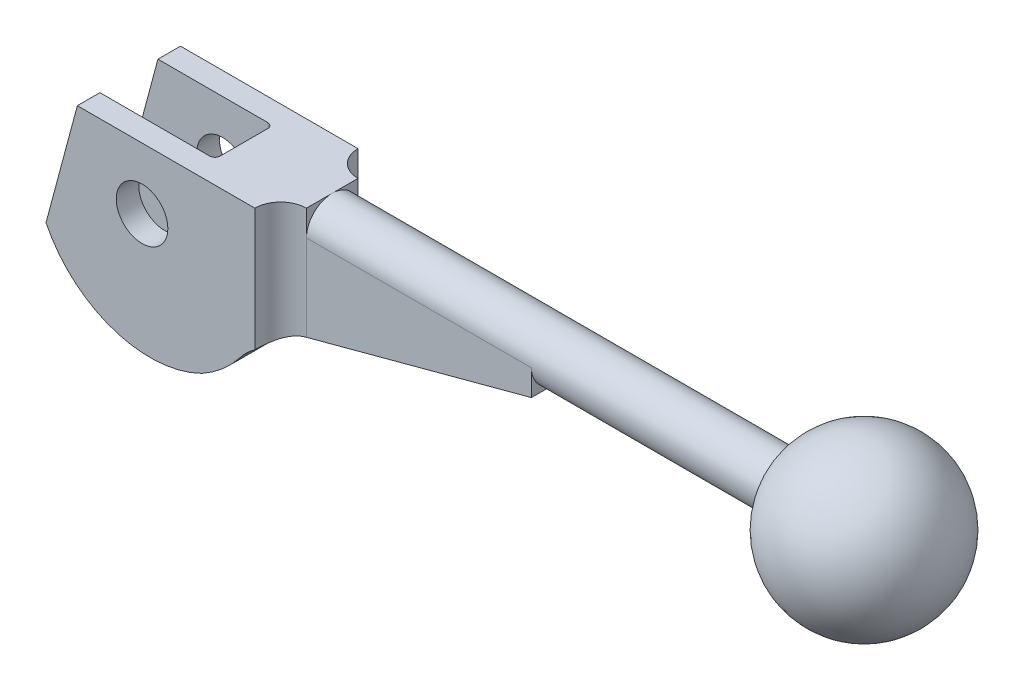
ISO-10303-21;
HEADER;
FILE_DESCRIPTION(('STEP AP214'),'2;1');
FILE_NAME('part.step','',(''),(''),'','','');
FILE_SCHEMA(('AUTOMOTIVE_DESIGN { 1 0 10303 214 1 1 1 1 }'));
ENDSEC;
DATA;
#1=APPLICATION_CONTEXT('core data for automotive mechanical design processes');
#2=APPLICATION_PROTOCOL_DEFINITION('international standard','automotive_design',2000,#1);
#3=PRODUCT_CONTEXT('',#1,'mechanical');
#4=PRODUCT('Part','Part','',(#3));
#5=PRODUCT_RELATED_PRODUCT_CATEGORY('part','',(#4));
#6=PRODUCT_DEFINITION_FORMATION('','',#4);
#7=PRODUCT_DEFINITION_CONTEXT('part definition',#1,'design');
#8=PRODUCT_DEFINITION('design','',#6,#7);
#9=PRODUCT_DEFINITION_SHAPE('','',#8);
#10=(LENGTH_UNIT() NAMED_UNIT(*) SI_UNIT(.MILLI.,.METRE.));
#11=(NAMED_UNIT(*) PLANE_ANGLE_UNIT() SI_UNIT($,.RADIAN.));
#12=(NAMED_UNIT(*) SI_UNIT($,.STERADIAN.) SOLID_ANGLE_UNIT());
#13=UNCERTAINTY_MEASURE_WITH_UNIT(LENGTH_MEASURE(1.E-05),#10,'distance_accuracy_value','');
#14=(GEOMETRIC_REPRESENTATION_CONTEXT(3) GLOBAL_UNCERTAINTY_ASSIGNED_CONTEXT((#13)) GLOBAL_UNIT_ASSIGNED_CONTEXT((#10,
#11,#12)) REPRESENTATION_CONTEXT('',''));
#15=CARTESIAN_POINT('',(0.,0.,0.));
#16=DIRECTION('',(0.,0.,1.));
#17=DIRECTION('',(1.,0.,0.));
#18=AXIS2_PLACEMENT_3D('',#15,#16,#17);
#19=CARTESIAN_POINT('',(-18.0306630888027,102.837421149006,3.7));
#20=DIRECTION('',(-0.258819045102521,0.965925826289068,0.));
#21=DIRECTION('',(-0.965925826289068,-0.258819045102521,0.));
#22=AXIS2_PLACEMENT_3D('',#19,#20,#21);
#23=CYLINDRICAL_SURFACE('',#22,0.8);
#24=DIRECTION('',(0.258819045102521,-0.965925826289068,0.));
#25=VECTOR('',#24,1.);
#26=CARTESIAN_POINT('',(-17.2579224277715,103.044476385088,3.7));
#27=LINE('',#26,#25);
#28=CARTESIAN_POINT('',(13.9013647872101,-13.2435666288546,3.7));
#29=VERTEX_POINT('',#28);
#30=CARTESIAN_POINT('',(7.80724447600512,9.5,3.7));
#31=VERTEX_POINT('',#30);
#32=EDGE_CURVE('E225',#29,#31,#27,.F.);
#33=ORIENTED_EDGE('',*,*,#32,.F.);
#34=CARTESIAN_POINT('',(13.2482136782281,-13.8969361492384,4.5));
#35=CARTESIAN_POINT('',(13.2976136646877,-13.8498706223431,4.5000178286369));
#36=CARTESIAN_POINT('',(13.3467861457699,-13.8024634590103,4.49327269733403));
#37=CARTESIAN_POINT('',(13.4429902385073,-13.7087684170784,4.4665040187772));
#38=CARTESIAN_POINT('',(13.4900102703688,-13.6624871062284,4.44641602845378));
#39=CARTESIAN_POINT('',(13.5729212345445,-13.5800863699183,4.39723866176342));
#40=CARTESIAN_POINT('',(13.6094197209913,-13.5434887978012,4.36997060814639));
#41=CARTESIAN_POINT('',(13.6779098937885,-13.4743135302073,4.30640427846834));
#42=CARTESIAN_POINT('',(13.7099160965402,-13.4417229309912,4.27013618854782));
#43=CARTESIAN_POINT('',(13.7611973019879,-13.3891923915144,4.19868446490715));
#44=CARTESIAN_POINT('',(13.7816982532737,-13.3680774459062,4.16523733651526));
#45=CARTESIAN_POINT('',(13.8185102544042,-13.3300215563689,4.09389019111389));
#46=CARTESIAN_POINT('',(13.8348204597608,-13.3130814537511,4.05598927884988));
#47=CARTESIAN_POINT('',(13.8625710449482,-13.2841835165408,3.9763426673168));
#48=CARTESIAN_POINT('',(13.8739794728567,-13.2722583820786,3.9345738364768));
#49=CARTESIAN_POINT('',(13.8910962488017,-13.2543427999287,3.84870754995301));
#50=CARTESIAN_POINT('',(13.8968194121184,-13.2483369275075,3.80461646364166));
#51=CARTESIAN_POINT('',(13.9001423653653,-13.2448496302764,3.75020495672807));
#52=CARTESIAN_POINT('',(13.9006008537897,-13.244368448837,3.7401684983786));
#53=CARTESIAN_POINT('',(13.9012115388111,-13.243727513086,3.72008944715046));
#54=CARTESIAN_POINT('',(13.9013641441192,-13.2435673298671,3.71004688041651));
#55=CARTESIAN_POINT('',(13.9013647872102,-13.2435666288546,3.7));
#56=B_SPLINE_CURVE_WITH_KNOTS('',3,(#34,#35,#36,#37,#38,#39,#40,#41,#42,#43,#44,#45,#46,#47,#48,
#49,#50,#51,#52,#53,#54,#55),.UNSPECIFIED.,.F.,.F.,(4,2,2,2,2,2,2,2,2,2,4),(0.,
0.204503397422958,0.410001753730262,0.584414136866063,0.758249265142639,0.891359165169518,
1.02449586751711,1.15848771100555,1.2921294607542,1.32229938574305,1.352428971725),.UNSPECIFIED.);
#57=CARTESIAN_POINT('',(13.2482136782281,-13.8969361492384,4.5));
#58=VERTEX_POINT('',#57);
#59=EDGE_CURVE('E165',#58,#29,#56,.T.);
#60=ORIENTED_EDGE('',*,*,#59,.F.);
#61=DIRECTION('',(0.258819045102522,-0.965925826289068,0.));
#62=VECTOR('',#61,1.);
#63=CARTESIAN_POINT('',(6.97902353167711,9.5,4.5));
#64=LINE('',#63,#62);
#65=CARTESIAN_POINT('',(6.97902353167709,9.5,4.5));
#66=VERTEX_POINT('',#65);
#67=EDGE_CURVE('E164',#66,#58,#64,.T.);
#68=ORIENTED_EDGE('',*,*,#67,.F.);
#69=CARTESIAN_POINT('',(6.97902353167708,9.5,3.7));
#70=DIRECTION('',(0.,-1.,0.));
#71=DIRECTION('',(-1.,0.,0.));
#72=AXIS2_PLACEMENT_3D('',#69,#70,#71);
#73=ELLIPSE('',#72,0.828220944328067,0.8);
#74=EDGE_CURVE('E18',#31,#66,#73,.T.);
#75=ORIENTED_EDGE('',*,*,#74,.F.);
#76=EDGE_LOOP('',(#33,#60,#68,#75));
#77=FACE_BOUND('',#76,.T.);
#78=ADVANCED_FACE('F14',(#77),#23,.F.);
#79=CARTESIAN_POINT('',(0.,0.,8.));
#80=DIRECTION('',(0.,0.,1.));
#81=DIRECTION('',(1.,0.,0.));
#82=AXIS2_PLACEMENT_3D('',#79,#80,#81);
#83=CYLINDRICAL_SURFACE('',#82,4.);
#84=CARTESIAN_POINT('',(0.,0.,-4.5));
#85=DIRECTION('',(0.,0.,1.));
#86=DIRECTION('',(1.,0.,0.));
#87=AXIS2_PLACEMENT_3D('',#84,#85,#86);
#88=CIRCLE('',#87,4.);
#89=CARTESIAN_POINT('',(4.,0.,-4.5));
#90=VERTEX_POINT('',#89);
#91=EDGE_CURVE('E222',#90,#90,#88,.F.);
#92=ORIENTED_EDGE('',*,*,#91,.F.);
#93=EDGE_LOOP('',(#92));
#94=FACE_BOUND('',#93,.T.);
#95=CARTESIAN_POINT('',(0.,0.,-8.));
#96=DIRECTION('',(0.,0.,1.));
#97=DIRECTION('',(1.,0.,0.));
#98=AXIS2_PLACEMENT_3D('',#95,#96,#97);
#99=CIRCLE('',#98,4.);
#100=CARTESIAN_POINT('',(4.,0.,-8.));
#101=VERTEX_POINT('',#100);
#102=EDGE_CURVE('E237',#101,#101,#99,.F.);
#103=ORIENTED_EDGE('',*,*,#102,.T.);
#104=EDGE_LOOP('',(#103));
#105=FACE_BOUND('',#104,.T.);
#106=ADVANCED_FACE('F435',(#94,#105),#83,.F.);
#107=CARTESIAN_POINT('',(1.25,-0.699999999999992,8.));
#108=DIRECTION('',(0.,0.,1.));
#109=DIRECTION('',(1.,0.,0.));
#110=AXIS2_PLACEMENT_3D('',#107,#108,#109);
#111=CYLINDRICAL_SURFACE('',#110,18.);
#112=CARTESIAN_POINT('',(1.25,-0.699999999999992,-8.));
#113=DIRECTION('',(0.,0.,1.));
#114=DIRECTION('',(1.,0.,0.));
#115=AXIS2_PLACEMENT_3D('',#112,#113,#114);
#116=CIRCLE('',#115,18.);
#117=CARTESIAN_POINT('',(-14.9,-8.64842751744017,-8.));
#118=VERTEX_POINT('',#117);
#119=CARTESIAN_POINT('',(9.25730095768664,-16.8208911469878,-8.));
#120=VERTEX_POINT('',#119);
#121=EDGE_CURVE('E236',#118,#120,#116,.T.);
#122=ORIENTED_EDGE('',*,*,#121,.T.);
#123=DIRECTION('',(0.,0.,1.));
#124=VECTOR('',#123,1.);
#125=CARTESIAN_POINT('',(9.25730095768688,-16.8208911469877,8.));
#126=LINE('',#125,#124);
#127=CARTESIAN_POINT('',(9.25730095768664,-16.8208911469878,-4.5));
#128=VERTEX_POINT('',#127);
#129=EDGE_CURVE('E246',#128,#120,#126,.F.);
#130=ORIENTED_EDGE('',*,*,#129,.F.);
#131=CARTESIAN_POINT('',(1.25,-0.699999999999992,-4.5));
#132=DIRECTION('',(0.,0.,1.));
#133=DIRECTION('',(1.,0.,0.));
#134=AXIS2_PLACEMENT_3D('',#131,#132,#133);
#135=CIRCLE('',#134,18.);
#136=CARTESIAN_POINT('',(-14.9,-8.64842751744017,-4.5));
#137=VERTEX_POINT('',#136);
#138=EDGE_CURVE('E221',#137,#128,#135,.T.);
#139=ORIENTED_EDGE('',*,*,#138,.F.);
#140=DIRECTION('',(0.,0.,1.));
#141=VECTOR('',#140,1.);
#142=CARTESIAN_POINT('',(-14.9,-8.64842751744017,8.));
#143=LINE('',#142,#141);
#144=EDGE_CURVE('E249',#118,#137,#143,.T.);
#145=ORIENTED_EDGE('',*,*,#144,.F.);
#146=EDGE_LOOP('',(#122,#130,#139,#145));
#147=FACE_BOUND('',#146,.T.);
#148=ADVANCED_FACE('F366',(#147),#111,.T.);
#149=CARTESIAN_POINT('',(-18.0306630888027,102.837421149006,-3.7));
#150=DIRECTION('',(-0.258819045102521,0.965925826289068,0.));
#151=DIRECTION('',(-0.965925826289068,-0.258819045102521,0.));
#152=AXIS2_PLACEMENT_3D('',#149,#150,#151);
#153=CYLINDRICAL_SURFACE('',#152,0.8);
#154=DIRECTION('',(-0.258819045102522,0.965925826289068,0.));
#155=VECTOR('',#154,1.);
#156=CARTESIAN_POINT('',(13.2482136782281,-13.8969361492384,-4.5));
#157=LINE('',#156,#155);
#158=CARTESIAN_POINT('',(13.2482136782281,-13.8969361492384,-4.5));
#159=VERTEX_POINT('',#158);
#160=CARTESIAN_POINT('',(6.97902353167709,9.5,-4.5));
#161=VERTEX_POINT('',#160);
#162=EDGE_CURVE('E213',#159,#161,#157,.T.);
#163=ORIENTED_EDGE('',*,*,#162,.F.);
#164=CARTESIAN_POINT('',(13.9013647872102,-13.2435666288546,-3.7));
#165=CARTESIAN_POINT('',(13.9013658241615,-13.2435652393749,-3.72021879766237));
#166=CARTESIAN_POINT('',(13.900744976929,-13.2442172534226,-3.74042682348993));
#167=CARTESIAN_POINT('',(13.8982758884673,-13.2468083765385,-3.78067709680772));
#168=CARTESIAN_POINT('',(13.8964281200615,-13.2487469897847,-3.80071940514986));
#169=CARTESIAN_POINT('',(13.8890957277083,-13.2564351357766,-3.86018215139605));
#170=CARTESIAN_POINT('',(13.8818215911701,-13.264057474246,-3.89916781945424));
#171=CARTESIAN_POINT('',(13.8628669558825,-13.2838663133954,-3.97474758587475));
#172=CARTESIAN_POINT('',(13.8511913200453,-13.296047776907,-4.01134427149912));
#173=CARTESIAN_POINT('',(13.8239312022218,-13.3243878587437,-4.08143577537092));
#174=CARTESIAN_POINT('',(13.8083428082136,-13.3405504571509,-4.1149274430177));
#175=CARTESIAN_POINT('',(13.7728035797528,-13.3772407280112,-4.18006821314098));
#176=CARTESIAN_POINT('',(13.7526496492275,-13.3979696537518,-4.21149207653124));
#177=CARTESIAN_POINT('',(13.7092459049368,-13.4423785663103,-4.26976088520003));
#178=CARTESIAN_POINT('',(13.6859953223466,-13.4660592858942,-4.29660468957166));
#179=CARTESIAN_POINT('',(13.6335759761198,-13.5191412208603,-4.34887446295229));
#180=CARTESIAN_POINT('',(13.6040338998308,-13.54887990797,-4.37358324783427));
#181=CARTESIAN_POINT('',(13.5424705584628,-13.6104149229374,-4.41655036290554));
#182=CARTESIAN_POINT('',(13.5104468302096,-13.6422132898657,-4.43480218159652));
#183=CARTESIAN_POINT('',(13.4408544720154,-13.7108008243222,-4.46642640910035));
#184=CARTESIAN_POINT('',(13.403071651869,-13.7477434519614,-4.47899650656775));
#185=CARTESIAN_POINT('',(13.3263143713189,-13.8221662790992,-4.49577922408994));
#186=CARTESIAN_POINT('',(13.287341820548,-13.8596455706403,-4.50000458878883));
#187=CARTESIAN_POINT('',(13.2482136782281,-13.8969361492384,-4.5));
#188=B_SPLINE_CURVE_WITH_KNOTS('',3,(#164,#165,#166,#167,#168,#169,#170,#171,#172,#173,#174,
#175,#176,#177,#178,#179,#180,#181,#182,#183,#184,#185,#186,#187),.UNSPECIFIED.,.F.,.F.,(4,2,2,
2,2,2,2,2,2,2,2,4),(0.,0.0606154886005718,0.121207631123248,0.24171325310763,0.362086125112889,
0.482579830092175,0.610181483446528,0.737814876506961,0.883210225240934,1.02875178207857,
1.19102739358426,1.35305497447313),.UNSPECIFIED.);
#189=CARTESIAN_POINT('',(13.9013647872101,-13.2435666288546,-3.7));
#190=VERTEX_POINT('',#189);
#191=EDGE_CURVE('E251',#190,#159,#188,.T.);
#192=ORIENTED_EDGE('',*,*,#191,.F.);
#193=DIRECTION('',(0.258819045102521,-0.965925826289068,0.));
#194=VECTOR('',#193,1.);
#195=CARTESIAN_POINT('',(-17.2579224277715,103.044476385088,-3.7));
#196=LINE('',#195,#194);
#197=CARTESIAN_POINT('',(7.80724447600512,9.5,-3.7));
#198=VERTEX_POINT('',#197);
#199=EDGE_CURVE('E228',#198,#190,#196,.T.);
#200=ORIENTED_EDGE('',*,*,#199,.F.);
#201=CARTESIAN_POINT('',(6.97902353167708,9.5,-3.7));
#202=DIRECTION('',(0.,-1.,0.));
#203=DIRECTION('',(-1.,0.,0.));
#204=AXIS2_PLACEMENT_3D('',#201,#202,#203);
#205=ELLIPSE('',#204,0.828220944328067,0.8);
#206=EDGE_CURVE('E162',#161,#198,#205,.T.);
#207=ORIENTED_EDGE('',*,*,#206,.F.);
#208=EDGE_LOOP('',(#163,#192,#200,#207));
#209=FACE_BOUND('',#208,.T.);
#210=ADVANCED_FACE('F344',(#209),#153,.F.);
#211=CARTESIAN_POINT('',(0.,0.,8.));
#212=DIRECTION('',(0.,0.,1.));
#213=DIRECTION('',(1.,0.,0.));
#214=AXIS2_PLACEMENT_3D('',#211,#212,#213);
#215=CYLINDRICAL_SURFACE('',#214,4.);
#216=CARTESIAN_POINT('',(0.,0.,4.5));
#217=DIRECTION('',(0.,0.,1.));
#218=DIRECTION('',(1.,0.,0.));
#219=AXIS2_PLACEMENT_3D('',#216,#217,#218);
#220=CIRCLE('',#219,4.);
#221=CARTESIAN_POINT('',(4.,0.,4.5));
#222=VERTEX_POINT('',#221);
#223=EDGE_CURVE('E170',#222,#222,#220,.T.);
#224=ORIENTED_EDGE('',*,*,#223,.F.);
#225=EDGE_LOOP('',(#224));
#226=FACE_BOUND('',#225,.T.);
#227=CARTESIAN_POINT('',(0.,0.,8.));
#228=DIRECTION('',(0.,0.,1.));
#229=DIRECTION('',(1.,0.,0.));
#230=AXIS2_PLACEMENT_3D('',#227,#228,#229);
#231=CIRCLE('',#230,4.);
#232=CARTESIAN_POINT('',(4.,0.,8.));
#233=VERTEX_POINT('',#232);
#234=EDGE_CURVE('E216',#233,#233,#231,.F.);
#235=ORIENTED_EDGE('',*,*,#234,.F.);
#236=EDGE_LOOP('',(#235));
#237=FACE_BOUND('',#236,.T.);
#238=ADVANCED_FACE('F358',(#226,#237),#215,.F.);
#239=CARTESIAN_POINT('',(1.25,-0.699999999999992,8.));
#240=DIRECTION('',(0.,0.,1.));
#241=DIRECTION('',(1.,0.,0.));
#242=AXIS2_PLACEMENT_3D('',#239,#240,#241);
#243=CYLINDRICAL_SURFACE('',#242,18.);
#244=CARTESIAN_POINT('',(1.25,-0.699999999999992,8.));
#245=DIRECTION('',(0.,0.,1.));
#246=DIRECTION('',(1.,0.,0.));
#247=AXIS2_PLACEMENT_3D('',#244,#245,#246);
#248=CIRCLE('',#247,18.);
#249=CARTESIAN_POINT('',(-14.9,-8.64842751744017,8.));
#250=VERTEX_POINT('',#249);
#251=CARTESIAN_POINT('',(9.25730095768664,-16.8208911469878,8.));
#252=VERTEX_POINT('',#251);
#253=EDGE_CURVE('E211',#250,#252,#248,.T.);
#254=ORIENTED_EDGE('',*,*,#253,.F.);
#255=DIRECTION('',(0.,0.,1.));
#256=VECTOR('',#255,1.);
#257=CARTESIAN_POINT('',(-14.9,-8.64842751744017,8.));
#258=LINE('',#257,#256);
#259=CARTESIAN_POINT('',(-14.9,-8.64842751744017,4.5));
#260=VERTEX_POINT('',#259);
#261=EDGE_CURVE('E241',#260,#250,#258,.T.);
#262=ORIENTED_EDGE('',*,*,#261,.F.);
#263=CARTESIAN_POINT('',(1.25,-0.699999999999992,4.5));
#264=DIRECTION('',(0.,0.,1.));
#265=DIRECTION('',(1.,0.,0.));
#266=AXIS2_PLACEMENT_3D('',#263,#264,#265);
#267=CIRCLE('',#266,18.);
#268=CARTESIAN_POINT('',(9.25730095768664,-16.8208911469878,4.5));
#269=VERTEX_POINT('',#268);
#270=EDGE_CURVE('E231',#269,#260,#267,.F.);
#271=ORIENTED_EDGE('',*,*,#270,.F.);
#272=DIRECTION('',(0.,0.,1.));
#273=VECTOR('',#272,1.);
#274=CARTESIAN_POINT('',(9.25730095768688,-16.8208911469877,8.));
#275=LINE('',#274,#273);
#276=EDGE_CURVE('E244',#252,#269,#275,.F.);
#277=ORIENTED_EDGE('',*,*,#276,.F.);
#278=EDGE_LOOP('',(#254,#262,#271,#277));
#279=FACE_BOUND('',#278,.T.);
#280=ADVANCED_FACE('F353',(#279),#243,.T.);
#281=CARTESIAN_POINT('',(0.,0.,8.));
#282=DIRECTION('',(0.,0.,1.));
#283=DIRECTION('',(1.,0.,0.));
#284=AXIS2_PLACEMENT_3D('',#281,#282,#283);
#285=CYLINDRICAL_SURFACE('',#284,19.2);
#286=DIRECTION('',(0.,0.,1.));
#287=VECTOR('',#286,1.);
#288=CARTESIAN_POINT('',(13.9013647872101,-13.2435666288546,3.7));
#289=LINE('',#288,#287);
#290=EDGE_CURVE('E227',#190,#29,#289,.T.);
#291=ORIENTED_EDGE('',*,*,#290,.F.);
#292=ORIENTED_EDGE('',*,*,#191,.T.);
#293=CARTESIAN_POINT('',(0.,0.,-4.5));
#294=DIRECTION('',(0.,0.,1.));
#295=DIRECTION('',(1.,0.,0.));
#296=AXIS2_PLACEMENT_3D('',#293,#294,#295);
#297=CIRCLE('',#296,19.2);
#298=EDGE_CURVE('E217',#128,#159,#297,.T.);
#299=ORIENTED_EDGE('',*,*,#298,.F.);
#300=ORIENTED_EDGE('',*,*,#129,.T.);
#301=CARTESIAN_POINT('',(0.,0.,-8.));
#302=DIRECTION('',(0.,0.,1.));
#303=DIRECTION('',(1.,0.,0.));
#304=AXIS2_PLACEMENT_3D('',#301,#302,#303);
#305=CIRCLE('',#304,19.2);
#306=CARTESIAN_POINT('',(15.2438186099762,-11.6733026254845,-8.));
#307=VERTEX_POINT('',#306);
#308=EDGE_CURVE('E243',#120,#307,#305,.T.);
#309=ORIENTED_EDGE('',*,*,#308,.T.);
#310=DIRECTION('',(0.,0.,1.));
#311=VECTOR('',#310,1.);
#312=CARTESIAN_POINT('',(15.2438186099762,-11.6733026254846,8.));
#313=LINE('',#312,#311);
#314=CARTESIAN_POINT('',(15.2438186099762,-11.6733026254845,8.));
#315=VERTEX_POINT('',#314);
#316=EDGE_CURVE('E238',#307,#315,#313,.T.);
#317=ORIENTED_EDGE('',*,*,#316,.T.);
#318=CARTESIAN_POINT('',(0.,0.,8.));
#319=DIRECTION('',(0.,0.,1.));
#320=DIRECTION('',(1.,0.,0.));
#321=AXIS2_PLACEMENT_3D('',#318,#319,#320);
#322=CIRCLE('',#321,19.2);
#323=EDGE_CURVE('E212',#252,#315,#322,.T.);
#324=ORIENTED_EDGE('',*,*,#323,.F.);
#325=ORIENTED_EDGE('',*,*,#276,.T.);
#326=CARTESIAN_POINT('',(0.,0.,4.5));
#327=DIRECTION('',(0.,0.,1.));
#328=DIRECTION('',(1.,0.,0.));
#329=AXIS2_PLACEMENT_3D('',#326,#327,#328);
#330=CIRCLE('',#329,19.2);
#331=EDGE_CURVE('E169',#58,#269,#330,.F.);
#332=ORIENTED_EDGE('',*,*,#331,.F.);
#333=ORIENTED_EDGE('',*,*,#59,.T.);
#334=EDGE_LOOP('',(#291,#292,#299,#300,#309,#317,#324,#325,#332,#333));
#335=FACE_BOUND('',#334,.T.);
#336=ADVANCED_FACE('F348',(#335),#285,.T.);
#337=CARTESIAN_POINT('',(-14.9,-8.64842751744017,8.));
#338=DIRECTION('',(-0.965925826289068,0.258819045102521,0.));
#339=DIRECTION('',(-0.258819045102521,-0.965925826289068,0.));
#340=AXIS2_PLACEMENT_3D('',#337,#338,#339);
#341=PLANE('',#340);
#342=DIRECTION('',(0.,0.,-1.));
#343=VECTOR('',#342,1.);
#344=CARTESIAN_POINT('',(-10.0371435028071,9.5,8.));
#345=LINE('',#344,#343);
#346=CARTESIAN_POINT('',(-10.0371435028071,9.5,-4.5));
#347=VERTEX_POINT('',#346);
#348=CARTESIAN_POINT('',(-10.0371435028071,9.5,-8.));
#349=VERTEX_POINT('',#348);
#350=EDGE_CURVE('E191',#347,#349,#345,.T.);
#351=ORIENTED_EDGE('',*,*,#350,.T.);
#352=DIRECTION('',(-0.258819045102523,-0.965925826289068,0.));
#353=VECTOR('',#352,1.);
#354=CARTESIAN_POINT('',(-10.0371435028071,9.5,-8.));
#355=LINE('',#354,#353);
#356=EDGE_CURVE('E233',#349,#118,#355,.T.);
#357=ORIENTED_EDGE('',*,*,#356,.T.);
#358=ORIENTED_EDGE('',*,*,#144,.T.);
#359=DIRECTION('',(-0.258819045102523,-0.965925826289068,0.));
#360=VECTOR('',#359,1.);
#361=CARTESIAN_POINT('',(-10.0371435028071,9.5,-4.5));
#362=LINE('',#361,#360);
#363=EDGE_CURVE('E218',#347,#137,#362,.T.);
#364=ORIENTED_EDGE('',*,*,#363,.F.);
#365=EDGE_LOOP('',(#351,#357,#358,#364));
#366=FACE_BOUND('',#365,.T.);
#367=ADVANCED_FACE('F318',(#366),#341,.T.);
#368=CARTESIAN_POINT('',(0.,0.,-8.));
#369=DIRECTION('',(0.,0.,1.));
#370=DIRECTION('',(1.,0.,0.));
#371=AXIS2_PLACEMENT_3D('',#368,#369,#370);
#372=PLANE('',#371);
#373=ORIENTED_EDGE('',*,*,#308,.F.);
#374=ORIENTED_EDGE('',*,*,#121,.F.);
#375=ORIENTED_EDGE('',*,*,#356,.F.);
#376=DIRECTION('',(1.,0.,0.));
#377=VECTOR('',#376,1.);
#378=CARTESIAN_POINT('',(23.5,9.5,-8.));
#379=LINE('',#378,#377);
#380=CARTESIAN_POINT('',(17.5,9.5,-8.));
#381=VERTEX_POINT('',#380);
#382=EDGE_CURVE('E189',#349,#381,#379,.T.);
#383=ORIENTED_EDGE('',*,*,#382,.T.);
#384=DIRECTION('',(0.,1.,0.));
#385=VECTOR('',#384,1.);
#386=CARTESIAN_POINT('',(17.5,19.5,-8.));
#387=LINE('',#386,#385);
#388=CARTESIAN_POINT('',(17.5,-9.52514578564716,-8.));
#389=VERTEX_POINT('',#388);
#390=EDGE_CURVE('E192',#381,#389,#387,.F.);
#391=ORIENTED_EDGE('',*,*,#390,.T.);
#392=CARTESIAN_POINT('',(23.1833074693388,-17.7531477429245,-8.));
#393=DIRECTION('',(0.,0.,1.));
#394=DIRECTION('',(1.,0.,0.));
#395=AXIS2_PLACEMENT_3D('',#392,#393,#394);
#396=CIRCLE('',#395,10.);
#397=EDGE_CURVE('E240',#389,#307,#396,.T.);
#398=ORIENTED_EDGE('',*,*,#397,.T.);
#399=EDGE_LOOP('',(#373,#374,#375,#383,#391,#398));
#400=FACE_BOUND('',#399,.T.);
#401=ORIENTED_EDGE('',*,*,#102,.F.);
#402=EDGE_LOOP('',(#401));
#403=FACE_BOUND('',#402,.T.);
#404=ADVANCED_FACE('F322',(#400,#403),#372,.F.);
#405=CARTESIAN_POINT('',(-14.9,-8.64842751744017,8.));
#406=DIRECTION('',(-0.965925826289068,0.258819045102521,0.));
#407=DIRECTION('',(-0.258819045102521,-0.965925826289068,0.));
#408=AXIS2_PLACEMENT_3D('',#405,#406,#407);
#409=PLANE('',#408);
#410=ORIENTED_EDGE('',*,*,#261,.T.);
#411=DIRECTION('',(-0.258819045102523,-0.965925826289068,0.));
#412=VECTOR('',#411,1.);
#413=CARTESIAN_POINT('',(-10.0371435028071,9.5,8.));
#414=LINE('',#413,#412);
#415=CARTESIAN_POINT('',(-10.0371435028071,9.5,8.));
#416=VERTEX_POINT('',#415);
#417=EDGE_CURVE('E208',#416,#250,#414,.T.);
#418=ORIENTED_EDGE('',*,*,#417,.F.);
#419=DIRECTION('',(0.,0.,-1.));
#420=VECTOR('',#419,1.);
#421=CARTESIAN_POINT('',(-10.0371435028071,9.5,8.));
#422=LINE('',#421,#420);
#423=CARTESIAN_POINT('',(-10.0371435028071,9.5,4.5));
#424=VERTEX_POINT('',#423);
#425=EDGE_CURVE('E178',#416,#424,#422,.T.);
#426=ORIENTED_EDGE('',*,*,#425,.T.);
#427=DIRECTION('',(0.258819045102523,0.965925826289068,0.));
#428=VECTOR('',#427,1.);
#429=CARTESIAN_POINT('',(-14.9,-8.64842751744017,4.5));
#430=LINE('',#429,#428);
#431=EDGE_CURVE('E177',#260,#424,#430,.T.);
#432=ORIENTED_EDGE('',*,*,#431,.F.);
#433=EDGE_LOOP('',(#410,#418,#426,#432));
#434=FACE_BOUND('',#433,.T.);
#435=ADVANCED_FACE('F386',(#434),#409,.T.);
#436=CARTESIAN_POINT('',(-117.714208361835,76.1272956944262,4.5));
#437=DIRECTION('',(0.,0.,-1.));
#438=DIRECTION('',(-1.,0.,0.));
#439=AXIS2_PLACEMENT_3D('',#436,#437,#438);
#440=PLANE('',#439);
#441=ORIENTED_EDGE('',*,*,#270,.T.);
#442=ORIENTED_EDGE('',*,*,#431,.T.);
#443=DIRECTION('',(1.,0.,0.));
#444=VECTOR('',#443,1.);
#445=CARTESIAN_POINT('',(23.5,9.5,4.5));
#446=LINE('',#445,#444);
#447=EDGE_CURVE('E159',#424,#66,#446,.T.);
#448=ORIENTED_EDGE('',*,*,#447,.T.);
#449=ORIENTED_EDGE('',*,*,#67,.T.);
#450=ORIENTED_EDGE('',*,*,#331,.T.);
#451=EDGE_LOOP('',(#441,#442,#448,#449,#450));
#452=FACE_BOUND('',#451,.T.);
#453=ORIENTED_EDGE('',*,*,#223,.T.);
#454=EDGE_LOOP('',(#453));
#455=FACE_BOUND('',#454,.T.);
#456=ADVANCED_FACE('F174',(#452,#455),#440,.T.);
#457=CARTESIAN_POINT('',(-17.2579224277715,103.044476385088,3.7));
#458=DIRECTION('',(-0.965925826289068,-0.258819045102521,0.));
#459=DIRECTION('',(0.258819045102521,-0.965925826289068,0.));
#460=AXIS2_PLACEMENT_3D('',#457,#458,#459);
#461=PLANE('',#460);
#462=ORIENTED_EDGE('',*,*,#290,.T.);
#463=ORIENTED_EDGE('',*,*,#32,.T.);
#464=DIRECTION('',(0.,0.,-1.));
#465=VECTOR('',#464,1.);
#466=CARTESIAN_POINT('',(7.80724447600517,9.5,8.));
#467=LINE('',#466,#465);
#468=EDGE_CURVE('E161',#31,#198,#467,.T.);
#469=ORIENTED_EDGE('',*,*,#468,.T.);
#470=ORIENTED_EDGE('',*,*,#199,.T.);
#471=EDGE_LOOP('',(#462,#463,#469,#470));
#472=FACE_BOUND('',#471,.T.);
#473=ADVANCED_FACE('F385',(#472),#461,.T.);
#474=CARTESIAN_POINT('',(-18.0306630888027,102.837421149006,-4.5));
#475=DIRECTION('',(0.,0.,1.));
#476=DIRECTION('',(1.,0.,0.));
#477=AXIS2_PLACEMENT_3D('',#474,#475,#476);
#478=PLANE('',#477);
#479=ORIENTED_EDGE('',*,*,#298,.T.);
#480=ORIENTED_EDGE('',*,*,#162,.T.);
#481=DIRECTION('',(1.,0.,0.));
#482=VECTOR('',#481,1.);
#483=CARTESIAN_POINT('',(23.5,9.5,-4.5));
#484=LINE('',#483,#482);
#485=EDGE_CURVE('E180',#161,#347,#484,.F.);
#486=ORIENTED_EDGE('',*,*,#485,.T.);
#487=ORIENTED_EDGE('',*,*,#363,.T.);
#488=ORIENTED_EDGE('',*,*,#138,.T.);
#489=EDGE_LOOP('',(#479,#480,#486,#487,#488));
#490=FACE_BOUND('',#489,.T.);
#491=ORIENTED_EDGE('',*,*,#91,.T.);
#492=EDGE_LOOP('',(#491));
#493=FACE_BOUND('',#492,.T.);
#494=ADVANCED_FACE('F310',(#490,#493),#478,.T.);
#495=CARTESIAN_POINT('',(0.,0.,8.));
#496=DIRECTION('',(0.,0.,1.));
#497=DIRECTION('',(1.,0.,0.));
#498=AXIS2_PLACEMENT_3D('',#495,#496,#497);
#499=PLANE('',#498);
#500=ORIENTED_EDGE('',*,*,#417,.T.);
#501=ORIENTED_EDGE('',*,*,#253,.T.);
#502=ORIENTED_EDGE('',*,*,#323,.T.);
#503=CARTESIAN_POINT('',(23.1833074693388,-17.7531477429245,8.));
#504=DIRECTION('',(0.,0.,1.));
#505=DIRECTION('',(1.,0.,0.));
#506=AXIS2_PLACEMENT_3D('',#503,#504,#505);
#507=CIRCLE('',#506,10.);
#508=CARTESIAN_POINT('',(17.5,-9.52514578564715,8.));
#509=VERTEX_POINT('',#508);
#510=EDGE_CURVE('E198',#315,#509,#507,.F.);
#511=ORIENTED_EDGE('',*,*,#510,.T.);
#512=DIRECTION('',(0.,1.,0.));
#513=VECTOR('',#512,1.);
#514=CARTESIAN_POINT('',(17.5,19.5,8.));
#515=LINE('',#514,#513);
#516=CARTESIAN_POINT('',(17.5,9.5,8.));
#517=VERTEX_POINT('',#516);
#518=EDGE_CURVE('E303',#509,#517,#515,.T.);
#519=ORIENTED_EDGE('',*,*,#518,.T.);
#520=DIRECTION('',(1.,0.,0.));
#521=VECTOR('',#520,1.);
#522=CARTESIAN_POINT('',(23.5,9.5,8.));
#523=LINE('',#522,#521);
#524=EDGE_CURVE('E182',#517,#416,#523,.F.);
#525=ORIENTED_EDGE('',*,*,#524,.T.);
#526=EDGE_LOOP('',(#500,#501,#502,#511,#519,#525));
#527=FACE_BOUND('',#526,.T.);
#528=ORIENTED_EDGE('',*,*,#234,.T.);
#529=EDGE_LOOP('',(#528));
#530=FACE_BOUND('',#529,.T.);
#531=ADVANCED_FACE('F459',(#527,#530),#499,.T.);
#532=CARTESIAN_POINT('',(23.1833074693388,-17.7531477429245,8.));
#533=DIRECTION('',(0.,0.,1.));
#534=DIRECTION('',(1.,0.,0.));
#535=AXIS2_PLACEMENT_3D('',#532,#533,#534);
#536=CYLINDRICAL_SURFACE('',#535,10.);
#537=ORIENTED_EDGE('',*,*,#316,.F.);
#538=ORIENTED_EDGE('',*,*,#397,.F.);
#539=CARTESIAN_POINT('',(17.5,-9.52514578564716,-8.));
#540=CARTESIAN_POINT('',(17.4999793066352,-9.52517625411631,-7.8987041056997));
#541=CARTESIAN_POINT('',(17.5038470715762,-9.52248882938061,-7.7974269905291));
#542=CARTESIAN_POINT('',(17.519197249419,-9.51190920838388,-7.59579614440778));
#543=CARTESIAN_POINT('',(17.5306741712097,-9.50402076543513,-7.49544180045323));
#544=CARTESIAN_POINT('',(17.5609781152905,-9.48333960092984,-7.29706626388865));
#545=CARTESIAN_POINT('',(17.5797549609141,-9.47058036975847,-7.19903388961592));
#546=CARTESIAN_POINT('',(17.6243732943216,-9.44056850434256,-7.00530919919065));
#547=CARTESIAN_POINT('',(17.650215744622,-9.42331525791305,-6.90961720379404));
#548=CARTESIAN_POINT('',(17.7377128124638,-9.36563355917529,-6.62747625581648));
#549=CARTESIAN_POINT('',(17.8094464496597,-9.31920505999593,-6.44526609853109));
#550=CARTESIAN_POINT('',(17.976989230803,-9.21476569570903,-6.0957614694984));
#551=CARTESIAN_POINT('',(18.0728388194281,-9.15673540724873,-5.92849270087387));
#552=CARTESIAN_POINT('',(18.2964142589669,-9.02752519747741,-5.59562337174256));
#553=CARTESIAN_POINT('',(18.426339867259,-8.95561442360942,-5.43178336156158));
#554=CARTESIAN_POINT('',(18.7091551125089,-8.80845954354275,-5.12693176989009));
#555=CARTESIAN_POINT('',(18.8620647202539,-8.73321257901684,-4.98594026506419));
#556=CARTESIAN_POINT('',(19.2104494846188,-8.57395018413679,-4.71162873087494));
#557=CARTESIAN_POINT('',(19.4088837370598,-8.49011827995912,-4.58189763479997));
#558=CARTESIAN_POINT('',(19.7227201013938,-8.37034682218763,-4.41456486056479));
#559=CARTESIAN_POINT('',(19.8299647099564,-8.33143932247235,-4.3633524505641));
#560=CARTESIAN_POINT('',(20.0493414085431,-8.25621920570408,-4.27042261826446));
#561=CARTESIAN_POINT('',(20.1614700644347,-8.21990481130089,-4.2286986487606));
#562=CARTESIAN_POINT('',(20.328101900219,-8.1692646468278,-4.17512164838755));
#563=CARTESIAN_POINT('',(20.3809818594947,-8.15366631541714,-4.15931562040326));
#564=CARTESIAN_POINT('',(20.4874910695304,-8.1232133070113,-4.12987428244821));
#565=CARTESIAN_POINT('',(20.541119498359,-8.10835788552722,-4.11623676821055));
#566=CARTESIAN_POINT('',(20.5951170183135,-8.09388948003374,-4.10369575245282));
#567=B_SPLINE_CURVE_WITH_KNOTS('',3,(#539,#540,#541,#542,#543,#544,#545,#546,#547,#548,#549,
#550,#551,#552,#553,#554,#555,#556,#557,#558,#559,#560,#561,#562,#563,#564,#565,#566),
.UNSPECIFIED.,.F.,.F.,(4,2,2,2,2,2,2,2,2,2,2,2,2,4),(0.,0.303747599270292,0.607276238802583,
0.908754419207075,1.21027368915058,1.81121209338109,2.41316512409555,3.07394539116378,
3.73530316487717,4.48570849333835,4.86048883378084,5.23500977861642,5.40702857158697,
5.57887137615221),.UNSPECIFIED.);
#568=CARTESIAN_POINT('',(20.5951170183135,-8.09388948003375,-4.10369575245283));
#569=VERTEX_POINT('',#568);
#570=EDGE_CURVE('E194',#389,#569,#567,.T.);
#571=ORIENTED_EDGE('',*,*,#570,.T.);
#572=DIRECTION('',(0.,0.,1.));
#573=VECTOR('',#572,1.);
#574=CARTESIAN_POINT('',(20.5951170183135,-8.09388948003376,8.));
#575=LINE('',#574,#573);
#576=CARTESIAN_POINT('',(20.5951170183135,-8.09388948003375,4.10369575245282));
#577=VERTEX_POINT('',#576);
#578=EDGE_CURVE('E195',#577,#569,#575,.F.);
#579=ORIENTED_EDGE('',*,*,#578,.F.);
#580=CARTESIAN_POINT('',(20.5951170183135,-8.09388948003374,4.10369575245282));
#581=CARTESIAN_POINT('',(20.4801384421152,-8.12468144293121,4.13039193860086));
#582=CARTESIAN_POINT('',(20.3668348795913,-8.15725735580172,4.16207559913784));
#583=CARTESIAN_POINT('',(20.1443176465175,-8.22539935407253,4.23492247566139));
#584=CARTESIAN_POINT('',(20.03510168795,-8.26096372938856,4.27608029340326));
#585=CARTESIAN_POINT('',(19.8216407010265,-8.33444707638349,4.36729468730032));
#586=CARTESIAN_POINT('',(19.7173836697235,-8.3723597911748,4.41732822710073));
#587=CARTESIAN_POINT('',(19.5141167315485,-8.44998160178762,4.52587286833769));
#588=CARTESIAN_POINT('',(19.4151075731,-8.48969095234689,4.58438517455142));
#589=CARTESIAN_POINT('',(19.1270784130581,-8.61038553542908,4.77175682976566));
#590=CARTESIAN_POINT('',(18.9464114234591,-8.69316501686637,4.91272922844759));
#591=CARTESIAN_POINT('',(18.6952219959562,-8.81637574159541,5.14582140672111));
#592=CARTESIAN_POINT('',(18.6147057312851,-8.85733688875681,5.22723988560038));
#593=CARTESIAN_POINT('',(18.460689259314,-8.93813614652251,5.3969759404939));
#594=CARTESIAN_POINT('',(18.3871896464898,-8.97797416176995,5.48529409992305));
#595=CARTESIAN_POINT('',(18.1718984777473,-9.09789244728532,5.76811216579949));
#596=CARTESIAN_POINT('',(18.0424850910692,-9.17476291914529,5.97389638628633));
#597=CARTESIAN_POINT('',(17.8770018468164,-9.27686593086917,6.30035723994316));
#598=CARTESIAN_POINT('',(17.826648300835,-9.3086755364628,6.41202562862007));
#599=CARTESIAN_POINT('',(17.7360316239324,-9.36684491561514,6.64072647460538));
#600=CARTESIAN_POINT('',(17.6957602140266,-9.39320915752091,6.75775443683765));
#601=CARTESIAN_POINT('',(17.6346231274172,-9.43370690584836,6.9667424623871));
#602=CARTESIAN_POINT('',(17.6114211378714,-9.44925297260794,7.0577555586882));
#603=CARTESIAN_POINT('',(17.5713966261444,-9.47624998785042,7.24175571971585));
#604=CARTESIAN_POINT('',(17.5545721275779,-9.48770220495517,7.33474216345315));
#605=CARTESIAN_POINT('',(17.5274380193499,-9.50624351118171,7.522700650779));
#606=CARTESIAN_POINT('',(17.5171702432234,-9.51330457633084,7.61768152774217));
#607=CARTESIAN_POINT('',(17.5034400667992,-9.52276993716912,7.80843674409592));
#608=CARTESIAN_POINT('',(17.4999829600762,-9.52517061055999,7.90421164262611));
#609=CARTESIAN_POINT('',(17.5,-9.52514578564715,8.));
#610=B_SPLINE_CURVE_WITH_KNOTS('',3,(#580,#581,#582,#583,#584,#585,#586,#587,#588,#589,#590,
#591,#592,#593,#594,#595,#596,#597,#598,#599,#600,#601,#602,#603,#604,#605,#606,#607,#608,#609),
.UNSPECIFIED.,.F.,.F.,(4,2,2,2,2,2,2,2,2,2,2,2,2,2,4),(0.,0.365780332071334,0.731352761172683,
1.09598989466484,1.46067889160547,2.18786594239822,2.5523728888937,2.91691069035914,
3.67676944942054,4.05596971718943,4.43485757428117,4.7201719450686,5.00539782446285,
5.29242579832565,5.57967677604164),.UNSPECIFIED.);
#611=EDGE_CURVE('E302',#577,#509,#610,.T.);
#612=ORIENTED_EDGE('',*,*,#611,.T.);
#613=ORIENTED_EDGE('',*,*,#510,.F.);
#614=EDGE_LOOP('',(#537,#538,#571,#579,#612,#613));
#615=FACE_BOUND('',#614,.T.);
#616=ADVANCED_FACE('F463',(#615),#536,.F.);
#617=CARTESIAN_POINT('',(56.4,1.5,8.));
#618=DIRECTION('',(0.258819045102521,-0.965925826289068,0.));
#619=DIRECTION('',(0.965925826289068,0.258819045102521,0.));
#620=AXIS2_PLACEMENT_3D('',#617,#618,#619);
#621=PLANE('',#620);
#622=DIRECTION('',(0.,0.,-1.));
#623=VECTOR('',#622,1.);
#624=CARTESIAN_POINT('',(56.4,1.5,0.));
#625=LINE('',#624,#623);
#626=CARTESIAN_POINT('',(56.4,1.5,4.));
#627=VERTEX_POINT('',#626);
#628=CARTESIAN_POINT('',(56.4,1.5,0.));
#629=VERTEX_POINT('',#628);
#630=EDGE_CURVE('E295',#627,#629,#625,.T.);
#631=ORIENTED_EDGE('',*,*,#630,.F.);
#632=DIRECTION('',(0.965925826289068,0.258819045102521,0.));
#633=VECTOR('',#632,1.);
#634=CARTESIAN_POINT('',(21.5,-7.85142681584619,4.));
#635=LINE('',#634,#633);
#636=CARTESIAN_POINT('',(21.5,-7.85142681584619,4.));
#637=VERTEX_POINT('',#636);
#638=EDGE_CURVE('E204',#637,#627,#635,.T.);
#639=ORIENTED_EDGE('',*,*,#638,.F.);
#640=CARTESIAN_POINT('',(21.5,-7.85142681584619,8.));
#641=DIRECTION('',(0.258819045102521,-0.965925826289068,0.));
#642=DIRECTION('',(0.965925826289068,0.258819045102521,0.));
#643=AXIS2_PLACEMENT_3D('',#640,#641,#642);
#644=ELLIPSE('',#643,4.14110472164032,4.);
#645=EDGE_CURVE('E490',#637,#577,#644,.F.);
#646=ORIENTED_EDGE('',*,*,#645,.T.);
#647=ORIENTED_EDGE('',*,*,#578,.T.);
#648=CARTESIAN_POINT('',(21.5,-7.85142681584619,-8.));
#649=DIRECTION('',(0.258819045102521,-0.965925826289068,0.));
#650=DIRECTION('',(0.965925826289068,0.258819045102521,0.));
#651=AXIS2_PLACEMENT_3D('',#648,#649,#650);
#652=ELLIPSE('',#651,4.14110472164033,4.);
#653=CARTESIAN_POINT('',(21.5,-7.85142681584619,-4.));
#654=VERTEX_POINT('',#653);
#655=EDGE_CURVE('E224',#569,#654,#652,.F.);
#656=ORIENTED_EDGE('',*,*,#655,.T.);
#657=DIRECTION('',(0.965925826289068,0.258819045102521,0.));
#658=VECTOR('',#657,1.);
#659=CARTESIAN_POINT('',(21.5,-7.85142681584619,-4.));
#660=LINE('',#659,#658);
#661=CARTESIAN_POINT('',(56.4,1.5,-4.));
#662=VERTEX_POINT('',#661);
#663=EDGE_CURVE('E199',#654,#662,#660,.T.);
#664=ORIENTED_EDGE('',*,*,#663,.T.);
#665=DIRECTION('',(0.,0.,-1.));
#666=VECTOR('',#665,1.);
#667=CARTESIAN_POINT('',(56.4,1.5,0.));
#668=LINE('',#667,#666);
#669=EDGE_CURVE('E293',#629,#662,#668,.T.);
#670=ORIENTED_EDGE('',*,*,#669,.F.);
#671=EDGE_LOOP('',(#631,#639,#646,#647,#656,#664,#670));
#672=FACE_BOUND('',#671,.T.);
#673=ADVANCED_FACE('F470',(#672),#621,.T.);
#674=CARTESIAN_POINT('',(21.5,19.5,-8.));
#675=DIRECTION('',(0.,1.,0.));
#676=DIRECTION('',(0.,0.,1.));
#677=AXIS2_PLACEMENT_3D('',#674,#675,#676);
#678=CYLINDRICAL_SURFACE('',#677,4.);
#679=ORIENTED_EDGE('',*,*,#655,.F.);
#680=ORIENTED_EDGE('',*,*,#570,.F.);
#681=ORIENTED_EDGE('',*,*,#390,.F.);
#682=CARTESIAN_POINT('',(21.5,9.5,-8.));
#683=DIRECTION('',(0.,1.,0.));
#684=DIRECTION('',(0.,0.,1.));
#685=AXIS2_PLACEMENT_3D('',#682,#683,#684);
#686=CIRCLE('',#685,4.);
#687=CARTESIAN_POINT('',(21.5,9.5,-4.));
#688=VERTEX_POINT('',#687);
#689=EDGE_CURVE('E188',#381,#688,#686,.T.);
#690=ORIENTED_EDGE('',*,*,#689,.T.);
#691=DIRECTION('',(0.,1.,0.));
#692=VECTOR('',#691,1.);
#693=CARTESIAN_POINT('',(21.5,5.5,-4.));
#694=LINE('',#693,#692);
#695=CARTESIAN_POINT('',(21.5,5.5,-4.));
#696=VERTEX_POINT('',#695);
#697=EDGE_CURVE('E202',#696,#688,#694,.T.);
#698=ORIENTED_EDGE('',*,*,#697,.F.);
#699=DIRECTION('',(0.,1.,0.));
#700=VECTOR('',#699,1.);
#701=CARTESIAN_POINT('',(21.5,1.196959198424E-13,-4.));
#702=LINE('',#701,#700);
#703=EDGE_CURVE('E203',#696,#654,#702,.F.);
#704=ORIENTED_EDGE('',*,*,#703,.T.);
#705=EDGE_LOOP('',(#679,#680,#681,#690,#698,#704));
#706=FACE_BOUND('',#705,.T.);
#707=ADVANCED_FACE('F502',(#706),#678,.F.);
#708=CARTESIAN_POINT('',(23.5,9.5,8.));
#709=DIRECTION('',(0.,-1.,0.));
#710=DIRECTION('',(0.,0.,-1.));
#711=AXIS2_PLACEMENT_3D('',#708,#709,#710);
#712=PLANE('',#711);
#713=ORIENTED_EDGE('',*,*,#206,.T.);
#714=ORIENTED_EDGE('',*,*,#468,.F.);
#715=ORIENTED_EDGE('',*,*,#74,.T.);
#716=ORIENTED_EDGE('',*,*,#447,.F.);
#717=ORIENTED_EDGE('',*,*,#425,.F.);
#718=ORIENTED_EDGE('',*,*,#524,.F.);
#719=CARTESIAN_POINT('',(21.5,9.5,8.));
#720=DIRECTION('',(0.,1.,0.));
#721=DIRECTION('',(0.,0.,1.));
#722=AXIS2_PLACEMENT_3D('',#719,#720,#721);
#723=CIRCLE('',#722,4.);
#724=CARTESIAN_POINT('',(21.5,9.5,4.));
#725=VERTEX_POINT('',#724);
#726=EDGE_CURVE('E304',#517,#725,#723,.F.);
#727=ORIENTED_EDGE('',*,*,#726,.T.);
#728=DIRECTION('',(0.,0.,-1.));
#729=VECTOR('',#728,1.);
#730=CARTESIAN_POINT('',(21.5,9.5,0.));
#731=LINE('',#730,#729);
#732=CARTESIAN_POINT('',(21.5,9.5,0.));
#733=VERTEX_POINT('',#732);
#734=EDGE_CURVE('E273',#733,#725,#731,.F.);
#735=ORIENTED_EDGE('',*,*,#734,.F.);
#736=DIRECTION('',(0.,0.,-1.));
#737=VECTOR('',#736,1.);
#738=CARTESIAN_POINT('',(21.5,9.5,0.));
#739=LINE('',#738,#737);
#740=EDGE_CURVE('E276',#688,#733,#739,.F.);
#741=ORIENTED_EDGE('',*,*,#740,.F.);
#742=ORIENTED_EDGE('',*,*,#689,.F.);
#743=ORIENTED_EDGE('',*,*,#382,.F.);
#744=ORIENTED_EDGE('',*,*,#350,.F.);
#745=ORIENTED_EDGE('',*,*,#485,.F.);
#746=EDGE_LOOP('',(#713,#714,#715,#716,#717,#718,#727,#735,#741,#742,#743,#744,#745));
#747=FACE_BOUND('',#746,.T.);
#748=ADVANCED_FACE('F156',(#747),#712,.F.);
#749=CARTESIAN_POINT('',(21.5,19.5,8.));
#750=DIRECTION('',(0.,1.,0.));
#751=DIRECTION('',(0.,0.,1.));
#752=AXIS2_PLACEMENT_3D('',#749,#750,#751);
#753=CYLINDRICAL_SURFACE('',#752,4.);
#754=ORIENTED_EDGE('',*,*,#645,.F.);
#755=DIRECTION('',(0.,1.,0.));
#756=VECTOR('',#755,1.);
#757=CARTESIAN_POINT('',(21.5,1.196959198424E-13,4.));
#758=LINE('',#757,#756);
#759=CARTESIAN_POINT('',(21.5,5.5,4.));
#760=VERTEX_POINT('',#759);
#761=EDGE_CURVE('E207',#760,#637,#758,.F.);
#762=ORIENTED_EDGE('',*,*,#761,.F.);
#763=DIRECTION('',(0.,1.,0.));
#764=VECTOR('',#763,1.);
#765=CARTESIAN_POINT('',(21.5,5.5,4.));
#766=LINE('',#765,#764);
#767=EDGE_CURVE('E269',#725,#760,#766,.F.);
#768=ORIENTED_EDGE('',*,*,#767,.F.);
#769=ORIENTED_EDGE('',*,*,#726,.F.);
#770=ORIENTED_EDGE('',*,*,#518,.F.);
#771=ORIENTED_EDGE('',*,*,#611,.F.);
#772=EDGE_LOOP('',(#754,#762,#768,#769,#770,#771));
#773=FACE_BOUND('',#772,.T.);
#774=ADVANCED_FACE('F493',(#773),#753,.F.);
#775=CARTESIAN_POINT('',(-1.14491749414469E-13,1.196959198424E-13,4.));
#776=DIRECTION('',(0.,0.,1.));
#777=DIRECTION('',(1.,0.,0.));
#778=AXIS2_PLACEMENT_3D('',#775,#776,#777);
#779=PLANE('',#778);
#780=DIRECTION('',(0.,1.,0.));
#781=VECTOR('',#780,1.);
#782=CARTESIAN_POINT('',(56.4,5.5,4.));
#783=LINE('',#782,#781);
#784=CARTESIAN_POINT('',(56.4,5.5,4.));
#785=VERTEX_POINT('',#784);
#786=EDGE_CURVE('E206',#785,#627,#783,.F.);
#787=ORIENTED_EDGE('',*,*,#786,.F.);
#788=DIRECTION('',(1.,0.,0.));
#789=VECTOR('',#788,1.);
#790=CARTESIAN_POINT('',(125.5,5.5,4.));
#791=LINE('',#790,#789);
#792=EDGE_CURVE('E272',#760,#785,#791,.T.);
#793=ORIENTED_EDGE('',*,*,#792,.F.);
#794=ORIENTED_EDGE('',*,*,#761,.T.);
#795=ORIENTED_EDGE('',*,*,#638,.T.);
#796=EDGE_LOOP('',(#787,#793,#794,#795));
#797=FACE_BOUND('',#796,.T.);
#798=ADVANCED_FACE('F498',(#797),#779,.T.);
#799=CARTESIAN_POINT('',(56.4,5.5,0.));
#800=DIRECTION('',(1.,0.,0.));
#801=DIRECTION('',(0.,0.,-1.));
#802=AXIS2_PLACEMENT_3D('',#799,#800,#801);
#803=PLANE('',#802);
#804=ORIENTED_EDGE('',*,*,#630,.T.);
#805=CARTESIAN_POINT('',(56.4,5.5,0.));
#806=DIRECTION('',(1.,0.,0.));
#807=DIRECTION('',(0.,0.,-1.));
#808=AXIS2_PLACEMENT_3D('',#805,#806,#807);
#809=CIRCLE('',#808,4.);
#810=EDGE_CURVE('E279',#785,#629,#809,.T.);
#811=ORIENTED_EDGE('',*,*,#810,.F.);
#812=ORIENTED_EDGE('',*,*,#786,.T.);
#813=EDGE_LOOP('',(#804,#811,#812));
#814=FACE_BOUND('',#813,.T.);
#815=ADVANCED_FACE('F555',(#814),#803,.T.);
#816=CARTESIAN_POINT('',(56.4,5.5,0.));
#817=DIRECTION('',(1.,0.,0.));
#818=DIRECTION('',(0.,0.,-1.));
#819=AXIS2_PLACEMENT_3D('',#816,#817,#818);
#820=PLANE('',#819);
#821=ORIENTED_EDGE('',*,*,#669,.T.);
#822=DIRECTION('',(0.,1.,0.));
#823=VECTOR('',#822,1.);
#824=CARTESIAN_POINT('',(56.4,1.196959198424E-13,-4.));
#825=LINE('',#824,#823);
#826=CARTESIAN_POINT('',(56.4,5.5,-4.));
#827=VERTEX_POINT('',#826);
#828=EDGE_CURVE('E291',#662,#827,#825,.T.);
#829=ORIENTED_EDGE('',*,*,#828,.T.);
#830=CARTESIAN_POINT('',(56.4,5.5,0.));
#831=DIRECTION('',(1.,0.,0.));
#832=DIRECTION('',(0.,0.,-1.));
#833=AXIS2_PLACEMENT_3D('',#830,#831,#832);
#834=CIRCLE('',#833,4.);
#835=EDGE_CURVE('E288',#629,#827,#834,.T.);
#836=ORIENTED_EDGE('',*,*,#835,.F.);
#837=EDGE_LOOP('',(#821,#829,#836));
#838=FACE_BOUND('',#837,.T.);
#839=ADVANCED_FACE('F557',(#838),#820,.T.);
#840=CARTESIAN_POINT('',(-1.14491749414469E-13,1.196959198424E-13,-4.));
#841=DIRECTION('',(0.,0.,1.));
#842=DIRECTION('',(1.,0.,0.));
#843=AXIS2_PLACEMENT_3D('',#840,#841,#842);
#844=PLANE('',#843);
#845=ORIENTED_EDGE('',*,*,#703,.F.);
#846=DIRECTION('',(1.,0.,0.));
#847=VECTOR('',#846,1.);
#848=CARTESIAN_POINT('',(125.5,5.5,-4.));
#849=LINE('',#848,#847);
#850=EDGE_CURVE('E284',#827,#696,#849,.F.);
#851=ORIENTED_EDGE('',*,*,#850,.F.);
#852=ORIENTED_EDGE('',*,*,#828,.F.);
#853=ORIENTED_EDGE('',*,*,#663,.F.);
#854=EDGE_LOOP('',(#845,#851,#852,#853));
#855=FACE_BOUND('',#854,.T.);
#856=ADVANCED_FACE('F548',(#855),#844,.F.);
#857=CARTESIAN_POINT('',(21.5,5.5,0.));
#858=DIRECTION('',(1.,0.,0.));
#859=DIRECTION('',(0.,0.,-1.));
#860=AXIS2_PLACEMENT_3D('',#857,#858,#859);
#861=PLANE('',#860);
#862=ORIENTED_EDGE('',*,*,#697,.T.);
#863=ORIENTED_EDGE('',*,*,#740,.T.);
#864=CARTESIAN_POINT('',(21.5,5.5,0.));
#865=DIRECTION('',(1.,0.,0.));
#866=DIRECTION('',(0.,0.,-1.));
#867=AXIS2_PLACEMENT_3D('',#864,#865,#866);
#868=CIRCLE('',#867,4.);
#869=EDGE_CURVE('E287',#696,#733,#868,.T.);
#870=ORIENTED_EDGE('',*,*,#869,.F.);
#871=EDGE_LOOP('',(#862,#863,#870));
#872=FACE_BOUND('',#871,.T.);
#873=ADVANCED_FACE('F545',(#872),#861,.T.);
#874=CARTESIAN_POINT('',(21.5,5.5,0.));
#875=DIRECTION('',(1.,0.,0.));
#876=DIRECTION('',(0.,0.,-1.));
#877=AXIS2_PLACEMENT_3D('',#874,#875,#876);
#878=PLANE('',#877);
#879=ORIENTED_EDGE('',*,*,#767,.T.);
#880=CARTESIAN_POINT('',(21.5,5.5,0.));
#881=DIRECTION('',(1.,0.,0.));
#882=DIRECTION('',(0.,0.,-1.));
#883=AXIS2_PLACEMENT_3D('',#880,#881,#882);
#884=CIRCLE('',#883,4.);
#885=EDGE_CURVE('E540',#733,#760,#884,.T.);
#886=ORIENTED_EDGE('',*,*,#885,.F.);
#887=ORIENTED_EDGE('',*,*,#734,.T.);
#888=EDGE_LOOP('',(#879,#886,#887));
#889=FACE_BOUND('',#888,.T.);
#890=ADVANCED_FACE('F539',(#889),#878,.T.);
#891=CARTESIAN_POINT('',(125.5,5.5,0.));
#892=DIRECTION('',(1.,0.,0.));
#893=DIRECTION('',(0.,0.,-1.));
#894=AXIS2_PLACEMENT_3D('',#891,#892,#893);
#895=CYLINDRICAL_SURFACE('',#894,4.);
#896=CARTESIAN_POINT('',(92.55,5.5,0.));
#897=DIRECTION('',(1.,0.,0.));
#898=DIRECTION('',(0.,0.,-1.));
#899=AXIS2_PLACEMENT_3D('',#896,#897,#898);
#900=CIRCLE('',#899,4.);
#901=CARTESIAN_POINT('',(92.55,5.5,-4.));
#902=VERTEX_POINT('',#901);
#903=EDGE_CURVE('E24',#902,#902,#900,.F.);
#904=ORIENTED_EDGE('',*,*,#903,.T.);
#905=EDGE_LOOP('',(#904));
#906=FACE_BOUND('',#905,.T.);
#907=ORIENTED_EDGE('',*,*,#869,.T.);
#908=ORIENTED_EDGE('',*,*,#885,.T.);
#909=ORIENTED_EDGE('',*,*,#792,.T.);
#910=ORIENTED_EDGE('',*,*,#810,.T.);
#911=ORIENTED_EDGE('',*,*,#835,.T.);
#912=ORIENTED_EDGE('',*,*,#850,.T.);
#913=EDGE_LOOP('',(#907,#908,#909,#910,#911,#912));
#914=FACE_BOUND('',#913,.T.);
#915=ADVANCED_FACE('F559',(#906,#914),#895,.T.);
#916=CARTESIAN_POINT('',(92.55,0.485271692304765,0.));
#917=DIRECTION('',(1.,0.,0.));
#918=DIRECTION('',(0.,1.,0.));
#919=AXIS2_PLACEMENT_3D('',#916,#917,#918);
#920=PLANE('',#919);
#921=CARTESIAN_POINT('',(92.55,0.485271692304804,0.));
#922=CARTESIAN_POINT('',(92.55,0.485270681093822,-0.140890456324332));
#923=CARTESIAN_POINT('',(92.55,0.491211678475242,-0.281764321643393));
#924=CARTESIAN_POINT('',(92.55,0.514934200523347,-0.562557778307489));
#925=CARTESIAN_POINT('',(92.55,0.532718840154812,-0.702477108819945));
#926=CARTESIAN_POINT('',(92.55,0.580027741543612,-0.980442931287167));
#927=CARTESIAN_POINT('',(92.55,0.609562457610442,-1.11848764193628));
#928=CARTESIAN_POINT('',(92.55,0.680173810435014,-1.39164746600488));
#929=CARTESIAN_POINT('',(92.55,0.721254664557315,-1.52676148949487));
#930=CARTESIAN_POINT('',(92.55,0.814621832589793,-1.79293222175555));
#931=CARTESIAN_POINT('',(92.55,0.866898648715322,-1.9239922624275));
#932=CARTESIAN_POINT('',(92.55,0.982327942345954,-2.18129043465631));
#933=CARTESIAN_POINT('',(92.55,1.04548442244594,-2.30752677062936));
#934=CARTESIAN_POINT('',(92.55,1.18216816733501,-2.55415204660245));
#935=CARTESIAN_POINT('',(92.55,1.25568900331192,-2.67454454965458));
#936=CARTESIAN_POINT('',(92.55,1.41263752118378,-2.90875349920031));
#937=CARTESIAN_POINT('',(92.55,1.49606884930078,-3.02256750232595));
#938=CARTESIAN_POINT('',(92.55,1.67220009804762,-3.24273286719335));
#939=CARTESIAN_POINT('',(92.55,1.76489756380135,-3.34908619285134));
#940=CARTESIAN_POINT('',(92.55,1.9589566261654,-3.55364530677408));
#941=CARTESIAN_POINT('',(92.55,2.06032140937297,-3.65184807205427));
#942=CARTESIAN_POINT('',(92.55,2.27092992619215,-3.83933282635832));
#943=CARTESIAN_POINT('',(92.55,2.38017105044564,-3.9286177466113));
#944=CARTESIAN_POINT('',(92.55,2.60582714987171,-4.0977003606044));
#945=CARTESIAN_POINT('',(92.55,2.72224475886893,-4.17749453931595));
#946=CARTESIAN_POINT('',(92.55,2.96134300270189,-4.32696081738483));
#947=CARTESIAN_POINT('',(92.55,3.08402119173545,-4.39663682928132));
#948=CARTESIAN_POINT('',(92.55,3.33485641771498,-4.52543230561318));
#949=CARTESIAN_POINT('',(92.55,3.46301546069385,-4.58454786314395));
#950=CARTESIAN_POINT('',(92.55,3.7238110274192,-4.69175030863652));
#951=CARTESIAN_POINT('',(92.55,3.85644587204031,-4.73984128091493));
#952=CARTESIAN_POINT('',(92.55,4.12534173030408,-4.82469707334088));
#953=CARTESIAN_POINT('',(92.55,4.26160406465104,-4.86145770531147));
#954=CARTESIAN_POINT('',(92.55,4.53670137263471,-4.92335404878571));
#955=CARTESIAN_POINT('',(92.55,4.67553538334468,-4.94849402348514));
#956=CARTESIAN_POINT('',(92.55,4.95484029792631,-4.98700441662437));
#957=CARTESIAN_POINT('',(92.55,5.09531178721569,-5.00037048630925));
#958=CARTESIAN_POINT('',(92.55,5.51758098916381,-5.02259289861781));
#959=CARTESIAN_POINT('',(92.55,5.80053302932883,-5.01364056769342));
#960=CARTESIAN_POINT('',(92.55,6.36076351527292,-4.94835673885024));
#961=CARTESIAN_POINT('',(92.55,6.63804195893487,-4.89202522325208));
#962=CARTESIAN_POINT('',(92.55,7.1792477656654,-4.73361130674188));
#963=CARTESIAN_POINT('',(92.55,7.44317511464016,-4.63152885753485));
#964=CARTESIAN_POINT('',(92.55,7.95013437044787,-4.38450307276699));
#965=CARTESIAN_POINT('',(92.55,8.19316628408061,-4.23955975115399));
#966=CARTESIAN_POINT('',(92.55,8.6514495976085,-3.91092889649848));
#967=CARTESIAN_POINT('',(92.55,8.86670100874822,-3.72724137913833));
#968=CARTESIAN_POINT('',(92.55,9.26330938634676,-3.32633585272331));
#969=CARTESIAN_POINT('',(92.55,9.44466634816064,-3.10911783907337));
#970=CARTESIAN_POINT('',(92.55,9.76833861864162,-2.64731763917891));
#971=CARTESIAN_POINT('',(92.55,9.91065392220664,-2.40273544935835));
#972=CARTESIAN_POINT('',(92.55,10.1522026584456,-1.89314986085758));
#973=CARTESIAN_POINT('',(92.55,10.2514360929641,-1.62814646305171));
#974=CARTESIAN_POINT('',(92.55,10.4040042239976,-1.0852411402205));
#975=CARTESIAN_POINT('',(92.55,10.4573389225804,-0.807339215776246));
#976=CARTESIAN_POINT('',(92.55,10.5165955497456,-0.246525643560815));
#977=CARTESIAN_POINT('',(92.55,10.5225174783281,0.0363860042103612));
#978=CARTESIAN_POINT('',(92.55,10.4867804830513,0.599188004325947));
#979=CARTESIAN_POINT('',(92.55,10.4451215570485,0.879078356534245));
#980=CARTESIAN_POINT('',(92.55,10.3154053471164,1.42789250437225));
#981=CARTESIAN_POINT('',(92.55,10.2273480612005,1.69681629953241));
#982=CARTESIAN_POINT('',(92.55,10.0073351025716,2.21606331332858));
#983=CARTESIAN_POINT('',(92.55,9.87537943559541,2.46638653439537));
#984=CARTESIAN_POINT('',(92.55,9.5713145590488,2.94132652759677));
#985=CARTESIAN_POINT('',(92.55,9.39920535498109,3.16594330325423));
#986=CARTESIAN_POINT('',(92.55,9.01972274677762,3.58309409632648));
#987=CARTESIAN_POINT('',(92.55,8.81234932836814,3.77562810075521));
#988=CARTESIAN_POINT('',(92.55,8.36821096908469,4.12314866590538));
#989=CARTESIAN_POINT('',(92.55,8.13144601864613,4.27813521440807));
#990=CARTESIAN_POINT('',(92.55,7.63529831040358,4.54615787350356));
#991=CARTESIAN_POINT('',(92.55,7.3759155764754,4.65919402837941));
#992=CARTESIAN_POINT('',(92.55,6.84169999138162,4.84011910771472));
#993=CARTESIAN_POINT('',(92.55,6.56686714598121,4.90800804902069));
#994=CARTESIAN_POINT('',(92.55,6.14927836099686,4.97452662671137));
#995=CARTESIAN_POINT('',(92.55,6.00911542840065,4.99081292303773));
#996=CARTESIAN_POINT('',(92.55,5.72792991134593,5.01152501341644));
#997=CARTESIAN_POINT('',(92.55,5.5869076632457,5.01595518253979));
#998=CARTESIAN_POINT('',(92.55,5.30494939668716,5.01291838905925));
#999=CARTESIAN_POINT('',(92.55,5.16401342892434,5.00544705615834));
#1000=CARTESIAN_POINT('',(92.55,4.88332136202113,4.97866176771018));
#1001=CARTESIAN_POINT('',(92.55,4.74356484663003,4.95935218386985));
#1002=CARTESIAN_POINT('',(92.55,4.46612395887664,4.90902082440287));
#1003=CARTESIAN_POINT('',(92.55,4.32844037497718,4.87799470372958));
#1004=CARTESIAN_POINT('',(92.55,4.05622714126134,4.80446552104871));
#1005=CARTESIAN_POINT('',(92.55,3.92169634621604,4.76196669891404));
#1006=CARTESIAN_POINT('',(92.55,3.65664091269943,4.6657702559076));
#1007=CARTESIAN_POINT('',(92.55,3.52611784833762,4.61206829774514));
#1008=CARTESIAN_POINT('',(92.55,3.27010809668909,4.49387941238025));
#1009=CARTESIAN_POINT('',(92.55,3.14461956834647,4.42939647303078));
#1010=CARTESIAN_POINT('',(92.55,2.89947924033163,4.29006700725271));
#1011=CARTESIAN_POINT('',(92.55,2.77982937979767,4.21521706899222));
#1012=CARTESIAN_POINT('',(92.55,2.54730467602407,4.05573160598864));
#1013=CARTESIAN_POINT('',(92.55,2.43442734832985,3.97109970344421));
#1014=CARTESIAN_POINT('',(92.55,2.21617301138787,3.79260586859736));
#1015=CARTESIAN_POINT('',(92.55,2.11079799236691,3.6987415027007));
#1016=CARTESIAN_POINT('',(92.55,1.90836781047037,3.50250518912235));
#1017=CARTESIAN_POINT('',(92.55,1.81130959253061,3.40013639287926));
#1018=CARTESIAN_POINT('',(92.55,1.62610179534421,3.18752278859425));
#1019=CARTESIAN_POINT('',(92.55,1.53795775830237,3.07727315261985));
#1020=CARTESIAN_POINT('',(92.55,1.37130453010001,2.84978035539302));
#1021=CARTESIAN_POINT('',(92.55,1.29279179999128,2.73253978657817));
#1022=CARTESIAN_POINT('',(92.55,1.14585923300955,2.49175958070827));
#1023=CARTESIAN_POINT('',(92.55,1.07744798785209,2.36821470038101));
#1024=CARTESIAN_POINT('',(92.55,0.951308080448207,2.11584398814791));
#1025=CARTESIAN_POINT('',(92.55,0.893575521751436,1.98702010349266));
#1026=CARTESIAN_POINT('',(92.55,0.789219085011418,1.72507952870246));
#1027=CARTESIAN_POINT('',(92.55,0.742585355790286,1.59196676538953));
#1028=CARTESIAN_POINT('',(92.55,0.66070350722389,1.32233166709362));
#1029=CARTESIAN_POINT('',(92.55,0.625452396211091,1.18581023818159));
#1030=CARTESIAN_POINT('',(92.55,0.559237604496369,0.875964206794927));
#1031=CARTESIAN_POINT('',(92.55,0.531523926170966,0.701935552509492));
#1032=CARTESIAN_POINT('',(92.55,0.494541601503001,0.351929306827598));
#1033=CARTESIAN_POINT('',(92.55,0.48527295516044,0.175951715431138));
#1034=CARTESIAN_POINT('',(92.55,0.485271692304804,0.));
#1035=B_SPLINE_CURVE_WITH_KNOTS('',3,(#921,#922,#923,#924,#925,#926,#927,#928,#929,#930,#931,
#932,#933,#934,#935,#936,#937,#938,#939,#940,#941,#942,#943,#944,#945,#946,#947,#948,#949,#950,
#951,#952,#953,#954,#955,#956,#957,#958,#959,#960,#961,#962,#963,#964,#965,#966,#967,#968,#969,
#970,#971,#972,#973,#974,#975,#976,#977,#978,#979,#980,#981,#982,#983,#984,#985,#986,#987,#988,
#989,#990,#991,#992,#993,#994,#995,#996,#997,#998,#999,#1000,#1001,#1002,#1003,#1004,#1005,
#1006,#1007,#1008,#1009,#1010,#1011,#1012,#1013,#1014,#1015,#1016,#1017,#1018,#1019,#1020,#1021,
#1022,#1023,#1024,#1025,#1026,#1027,#1028,#1029,#1030,#1031,#1032,#1033,#1034),.UNSPECIFIED.,
.T.,.F.,(4,2,2,2,2,2,2,2,2,2,2,2,2,2,2,2,2,2,2,2,2,2,2,2,2,2,2,2,2,2,2,2,2,2,2,2,2,2,2,2,2,2,2,
2,2,2,2,2,2,2,2,2,2,2,2,2,4),(0.,0.422517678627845,0.845146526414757,1.26815224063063,
1.69131266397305,2.11411552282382,2.53707426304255,2.95977179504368,3.38262532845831,
3.80536713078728,4.22826503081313,4.65102346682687,5.07393799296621,5.49668854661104,
5.91959517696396,6.34234487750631,6.76525065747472,7.18800116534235,7.61090775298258,
8.45581147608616,9.30071551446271,10.1456204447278,10.9905251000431,11.8354294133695,
12.6803338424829,13.5252383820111,14.3701428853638,15.2150473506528,16.0599518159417,
16.9048563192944,17.7497608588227,18.5946652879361,19.4395696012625,20.2844742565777,
21.1293791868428,21.9742832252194,22.819186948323,23.2420935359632,23.6648440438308,
24.0877498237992,24.5104995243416,24.9334061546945,25.3561567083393,25.7790712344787,
26.2018296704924,26.6247275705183,27.0474693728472,27.4703229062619,27.893020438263,
28.3159791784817,28.7387820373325,29.1619424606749,29.5849481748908,30.0075770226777,
30.4300947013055,30.9577579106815,31.4854211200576),.UNSPECIFIED.);
#1036=CARTESIAN_POINT('',(92.55,0.485271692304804,0.));
#1037=VERTEX_POINT('',#1036);
#1038=EDGE_CURVE('E9',#1037,#1037,#1035,.T.);
#1039=ORIENTED_EDGE('',*,*,#1038,.F.);
#1040=EDGE_LOOP('',(#1039));
#1041=FACE_BOUND('',#1040,.T.);
#1042=ORIENTED_EDGE('',*,*,#903,.F.);
#1043=EDGE_LOOP('',(#1042));
#1044=FACE_BOUND('',#1043,.T.);
#1045=ADVANCED_FACE('F260',(#1041,#1044),#920,.F.);
#1046=CARTESIAN_POINT('',(104.,5.5,0.));
#1047=DIRECTION('',(0.,-1.,0.));
#1048=DIRECTION('',(0.,0.,1.));
#1049=AXIS2_PLACEMENT_3D('',#1046,#1047,#1048);
#1050=SPHERICAL_SURFACE('',#1049,12.5);
#1051=CARTESIAN_POINT('',(104.,18.,0.));
#1052=VERTEX_POINT('',#1051);
#1053=VERTEX_LOOP('',#1052);
#1054=FACE_BOUND('',#1053,.T.);
#1055=CARTESIAN_POINT('',(104.,-7.,0.));
#1056=VERTEX_POINT('',#1055);
#1057=VERTEX_LOOP('',#1056);
#1058=FACE_BOUND('',#1057,.T.);
#1059=ORIENTED_EDGE('',*,*,#1038,.T.);
#1060=EDGE_LOOP('',(#1059));
#1061=FACE_BOUND('',#1060,.T.);
#1062=ADVANCED_FACE('F263',(#1054,#1058,#1061),#1050,.T.);
#1063=CLOSED_SHELL('',(#78,#106,#148,#210,#238,#280,#336,#367,#404,#435,#456,#473,#494,#531,
#616,#673,#707,#748,#774,#798,#815,#839,#856,#873,#890,#915,#1045,#1062));
#1064=MANIFOLD_SOLID_BREP('B1',#1063);
#1065=ADVANCED_BREP_SHAPE_REPRESENTATION('',(#18,#1064),#14);
#1066=SHAPE_DEFINITION_REPRESENTATION(#9,#1065);
ENDSEC;
END-ISO-10303-21;
